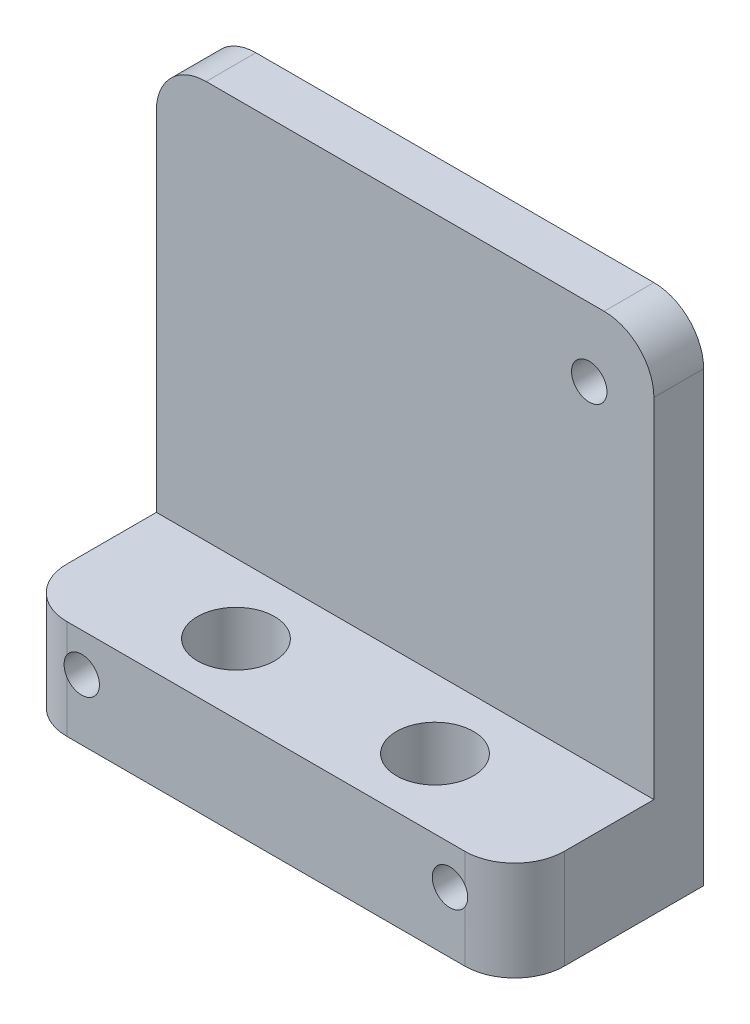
ISO-10303-21;
HEADER;
FILE_DESCRIPTION(('STEP AP214'),'2;1');
FILE_NAME('part.step','',(''),(''),'','','');
FILE_SCHEMA(('AUTOMOTIVE_DESIGN { 1 0 10303 214 1 1 1 1 }'));
ENDSEC;
DATA;
#1=APPLICATION_CONTEXT('core data for automotive mechanical design processes');
#2=APPLICATION_PROTOCOL_DEFINITION('international standard','automotive_design',2000,#1);
#3=PRODUCT_CONTEXT('',#1,'mechanical');
#4=PRODUCT('Part','Part','',(#3));
#5=PRODUCT_RELATED_PRODUCT_CATEGORY('part','',(#4));
#6=PRODUCT_DEFINITION_FORMATION('','',#4);
#7=PRODUCT_DEFINITION_CONTEXT('part definition',#1,'design');
#8=PRODUCT_DEFINITION('design','',#6,#7);
#9=PRODUCT_DEFINITION_SHAPE('','',#8);
#10=(LENGTH_UNIT() NAMED_UNIT(*) SI_UNIT(.MILLI.,.METRE.));
#11=(NAMED_UNIT(*) PLANE_ANGLE_UNIT() SI_UNIT($,.RADIAN.));
#12=(NAMED_UNIT(*) SI_UNIT($,.STERADIAN.) SOLID_ANGLE_UNIT());
#13=UNCERTAINTY_MEASURE_WITH_UNIT(LENGTH_MEASURE(1.E-05),#10,'distance_accuracy_value','');
#14=(GEOMETRIC_REPRESENTATION_CONTEXT(3) GLOBAL_UNCERTAINTY_ASSIGNED_CONTEXT((#13)) GLOBAL_UNIT_ASSIGNED_CONTEXT((#10,
#11,#12)) REPRESENTATION_CONTEXT('',''));
#15=CARTESIAN_POINT('',(0.,0.,0.));
#16=DIRECTION('',(0.,0.,1.));
#17=DIRECTION('',(1.,0.,0.));
#18=AXIS2_PLACEMENT_3D('',#15,#16,#17);
#19=CARTESIAN_POINT('',(15.875,6.35,12.065));
#20=DIRECTION('',(0.,0.,-1.));
#21=DIRECTION('',(-1.,0.,0.));
#22=AXIS2_PLACEMENT_3D('',#19,#20,#21);
#23=PLANE('',#22);
#24=DIRECTION('',(-1.,0.,0.));
#25=VECTOR('',#24,1.);
#26=CARTESIAN_POINT('',(15.875,6.35,12.065));
#27=LINE('',#26,#25);
#28=CARTESIAN_POINT('',(12.7,6.35,12.065));
#29=VERTEX_POINT('',#28);
#30=CARTESIAN_POINT('',(-12.7,6.35,12.065));
#31=VERTEX_POINT('',#30);
#32=EDGE_CURVE('E158',#29,#31,#27,.T.);
#33=ORIENTED_EDGE('',*,*,#32,.T.);
#34=DIRECTION('',(0.,-1.,0.));
#35=VECTOR('',#34,1.);
#36=CARTESIAN_POINT('',(-12.7,6.35,12.065));
#37=LINE('',#36,#35);
#38=CARTESIAN_POINT('',(-12.7,4.49743619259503,12.065));
#39=VERTEX_POINT('',#38);
#40=EDGE_CURVE('E183',#31,#39,#37,.T.);
#41=ORIENTED_EDGE('',*,*,#40,.T.);
#42=CARTESIAN_POINT('',(-11.75,3.88500000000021,12.065));
#43=DIRECTION('',(0.,0.,-1.));
#44=DIRECTION('',(-1.,0.,0.));
#45=AXIS2_PLACEMENT_3D('',#42,#43,#44);
#46=CIRCLE('',#45,1.1303);
#47=CARTESIAN_POINT('',(-12.7,3.27256380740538,12.065));
#48=VERTEX_POINT('',#47);
#49=EDGE_CURVE('E161',#39,#48,#46,.T.);
#50=ORIENTED_EDGE('',*,*,#49,.T.);
#51=DIRECTION('',(0.,-1.,0.));
#52=VECTOR('',#51,1.);
#53=CARTESIAN_POINT('',(-12.7,6.35,12.065));
#54=LINE('',#53,#52);
#55=CARTESIAN_POINT('',(-12.7,0.,12.065));
#56=VERTEX_POINT('',#55);
#57=EDGE_CURVE('E181',#48,#56,#54,.T.);
#58=ORIENTED_EDGE('',*,*,#57,.T.);
#59=DIRECTION('',(-1.,0.,0.));
#60=VECTOR('',#59,1.);
#61=CARTESIAN_POINT('',(15.875,0.,12.065));
#62=LINE('',#61,#60);
#63=CARTESIAN_POINT('',(12.7,0.,12.065));
#64=VERTEX_POINT('',#63);
#65=EDGE_CURVE('E146',#64,#56,#62,.T.);
#66=ORIENTED_EDGE('',*,*,#65,.F.);
#67=DIRECTION('',(0.,-1.,0.));
#68=VECTOR('',#67,1.);
#69=CARTESIAN_POINT('',(12.7,6.35,12.065));
#70=LINE('',#69,#68);
#71=CARTESIAN_POINT('',(12.7,3.27256380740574,12.065));
#72=VERTEX_POINT('',#71);
#73=EDGE_CURVE('E179',#64,#72,#70,.F.);
#74=ORIENTED_EDGE('',*,*,#73,.T.);
#75=CARTESIAN_POINT('',(11.75,3.88500000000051,12.065));
#76=DIRECTION('',(0.,0.,-1.));
#77=DIRECTION('',(-1.,0.,0.));
#78=AXIS2_PLACEMENT_3D('',#75,#76,#77);
#79=CIRCLE('',#78,1.1303);
#80=CARTESIAN_POINT('',(12.7,4.49743619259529,12.065));
#81=VERTEX_POINT('',#80);
#82=EDGE_CURVE('E253',#72,#81,#79,.T.);
#83=ORIENTED_EDGE('',*,*,#82,.T.);
#84=DIRECTION('',(0.,-1.,0.));
#85=VECTOR('',#84,1.);
#86=CARTESIAN_POINT('',(12.7,6.35,12.065));
#87=LINE('',#86,#85);
#88=EDGE_CURVE('E177',#81,#29,#87,.F.);
#89=ORIENTED_EDGE('',*,*,#88,.T.);
#90=EDGE_LOOP('',(#33,#41,#50,#58,#66,#74,#83,#89));
#91=FACE_BOUND('',#90,.T.);
#92=ADVANCED_FACE('F36',(#91),#23,.F.);
#93=CARTESIAN_POINT('',(15.875,0.,12.065));
#94=DIRECTION('',(0.,1.,0.));
#95=DIRECTION('',(0.,0.,1.));
#96=AXIS2_PLACEMENT_3D('',#93,#94,#95);
#97=PLANE('',#96);
#98=CARTESIAN_POINT('',(-6.35,0.,7.62));
#99=DIRECTION('',(0.,1.,0.));
#100=DIRECTION('',(0.,0.,1.));
#101=AXIS2_PLACEMENT_3D('',#98,#99,#100);
#102=CIRCLE('',#101,2.45745);
#103=CARTESIAN_POINT('',(-6.35,0.,10.07745));
#104=VERTEX_POINT('',#103);
#105=EDGE_CURVE('E272',#104,#104,#102,.T.);
#106=ORIENTED_EDGE('',*,*,#105,.T.);
#107=EDGE_LOOP('',(#106));
#108=FACE_BOUND('',#107,.T.);
#109=CARTESIAN_POINT('',(6.35,0.,7.61999999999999));
#110=DIRECTION('',(0.,1.,0.));
#111=DIRECTION('',(0.,0.,1.));
#112=AXIS2_PLACEMENT_3D('',#109,#110,#111);
#113=CIRCLE('',#112,2.45745);
#114=CARTESIAN_POINT('',(6.35,0.,10.07745));
#115=VERTEX_POINT('',#114);
#116=EDGE_CURVE('E266',#115,#115,#113,.T.);
#117=ORIENTED_EDGE('',*,*,#116,.T.);
#118=EDGE_LOOP('',(#117));
#119=FACE_BOUND('',#118,.T.);
#120=ORIENTED_EDGE('',*,*,#65,.T.);
#121=CARTESIAN_POINT('',(-12.7,0.,8.89));
#122=DIRECTION('',(0.,1.,0.));
#123=DIRECTION('',(0.,0.,1.));
#124=AXIS2_PLACEMENT_3D('',#121,#122,#123);
#125=CIRCLE('',#124,3.175);
#126=CARTESIAN_POINT('',(-15.875,0.,8.89));
#127=VERTEX_POINT('',#126);
#128=EDGE_CURVE('E292',#56,#127,#125,.F.);
#129=ORIENTED_EDGE('',*,*,#128,.T.);
#130=DIRECTION('',(0.,0.,-1.));
#131=VECTOR('',#130,1.);
#132=CARTESIAN_POINT('',(-15.875,0.,12.065));
#133=LINE('',#132,#131);
#134=CARTESIAN_POINT('',(-15.875,0.,0.));
#135=VERTEX_POINT('',#134);
#136=EDGE_CURVE('E144',#127,#135,#133,.T.);
#137=ORIENTED_EDGE('',*,*,#136,.T.);
#138=DIRECTION('',(-1.,0.,0.));
#139=VECTOR('',#138,1.);
#140=CARTESIAN_POINT('',(15.875,0.,0.));
#141=LINE('',#140,#139);
#142=CARTESIAN_POINT('',(15.875,0.,0.));
#143=VERTEX_POINT('',#142);
#144=EDGE_CURVE('E140',#143,#135,#141,.T.);
#145=ORIENTED_EDGE('',*,*,#144,.F.);
#146=DIRECTION('',(0.,0.,-1.));
#147=VECTOR('',#146,1.);
#148=CARTESIAN_POINT('',(15.875,0.,12.065));
#149=LINE('',#148,#147);
#150=CARTESIAN_POINT('',(15.875,0.,8.89));
#151=VERTEX_POINT('',#150);
#152=EDGE_CURVE('E126',#151,#143,#149,.T.);
#153=ORIENTED_EDGE('',*,*,#152,.F.);
#154=CARTESIAN_POINT('',(12.7,0.,8.89));
#155=DIRECTION('',(0.,1.,0.));
#156=DIRECTION('',(0.,0.,1.));
#157=AXIS2_PLACEMENT_3D('',#154,#155,#156);
#158=CIRCLE('',#157,3.175);
#159=EDGE_CURVE('E194',#151,#64,#158,.F.);
#160=ORIENTED_EDGE('',*,*,#159,.T.);
#161=EDGE_LOOP('',(#120,#129,#137,#145,#153,#160));
#162=FACE_BOUND('',#161,.T.);
#163=ADVANCED_FACE('F142',(#108,#119,#162),#97,.F.);
#164=CARTESIAN_POINT('',(15.875,0.,0.));
#165=DIRECTION('',(0.,0.,1.));
#166=DIRECTION('',(1.,0.,0.));
#167=AXIS2_PLACEMENT_3D('',#164,#165,#166);
#168=PLANE('',#167);
#169=CARTESIAN_POINT('',(11.75,27.3850000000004,0.));
#170=DIRECTION('',(0.,0.,-1.));
#171=DIRECTION('',(-1.,0.,0.));
#172=AXIS2_PLACEMENT_3D('',#169,#170,#171);
#173=CIRCLE('',#172,1.13029999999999);
#174=CARTESIAN_POINT('',(10.6197,27.3850000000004,0.));
#175=VERTEX_POINT('',#174);
#176=EDGE_CURVE('E263',#175,#175,#173,.T.);
#177=ORIENTED_EDGE('',*,*,#176,.F.);
#178=EDGE_LOOP('',(#177));
#179=FACE_BOUND('',#178,.T.);
#180=CARTESIAN_POINT('',(11.75,3.88500000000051,0.));
#181=DIRECTION('',(0.,0.,-1.));
#182=DIRECTION('',(-1.,0.,0.));
#183=AXIS2_PLACEMENT_3D('',#180,#181,#182);
#184=CIRCLE('',#183,1.13029999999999);
#185=CARTESIAN_POINT('',(10.6197,3.88500000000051,0.));
#186=VERTEX_POINT('',#185);
#187=EDGE_CURVE('E257',#186,#186,#184,.T.);
#188=ORIENTED_EDGE('',*,*,#187,.F.);
#189=EDGE_LOOP('',(#188));
#190=FACE_BOUND('',#189,.T.);
#191=CARTESIAN_POINT('',(-11.75,3.88500000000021,0.));
#192=DIRECTION('',(0.,0.,-1.));
#193=DIRECTION('',(-1.,0.,0.));
#194=AXIS2_PLACEMENT_3D('',#191,#192,#193);
#195=CIRCLE('',#194,1.13029999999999);
#196=CARTESIAN_POINT('',(-12.8803,3.88500000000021,0.));
#197=VERTEX_POINT('',#196);
#198=EDGE_CURVE('E251',#197,#197,#195,.T.);
#199=ORIENTED_EDGE('',*,*,#198,.F.);
#200=EDGE_LOOP('',(#199));
#201=FACE_BOUND('',#200,.T.);
#202=DIRECTION('',(-1.,0.,0.));
#203=VECTOR('',#202,1.);
#204=CARTESIAN_POINT('',(15.875,31.75,0.));
#205=LINE('',#204,#203);
#206=CARTESIAN_POINT('',(12.7,31.75,0.));
#207=VERTEX_POINT('',#206);
#208=CARTESIAN_POINT('',(-12.7,31.75,0.));
#209=VERTEX_POINT('',#208);
#210=EDGE_CURVE('E147',#207,#209,#205,.T.);
#211=ORIENTED_EDGE('',*,*,#210,.F.);
#212=CARTESIAN_POINT('',(12.7,28.575,0.));
#213=DIRECTION('',(0.,0.,1.));
#214=DIRECTION('',(1.,0.,0.));
#215=AXIS2_PLACEMENT_3D('',#212,#213,#214);
#216=CIRCLE('',#215,3.175);
#217=CARTESIAN_POINT('',(15.875,28.575,0.));
#218=VERTEX_POINT('',#217);
#219=EDGE_CURVE('E11',#207,#218,#216,.F.);
#220=ORIENTED_EDGE('',*,*,#219,.T.);
#221=DIRECTION('',(0.,1.,0.));
#222=VECTOR('',#221,1.);
#223=CARTESIAN_POINT('',(15.875,0.,0.));
#224=LINE('',#223,#222);
#225=EDGE_CURVE('E132',#143,#218,#224,.T.);
#226=ORIENTED_EDGE('',*,*,#225,.F.);
#227=ORIENTED_EDGE('',*,*,#144,.T.);
#228=DIRECTION('',(0.,1.,0.));
#229=VECTOR('',#228,1.);
#230=CARTESIAN_POINT('',(-15.875,0.,0.));
#231=LINE('',#230,#229);
#232=CARTESIAN_POINT('',(-15.875,28.575,0.));
#233=VERTEX_POINT('',#232);
#234=EDGE_CURVE('E160',#135,#233,#231,.T.);
#235=ORIENTED_EDGE('',*,*,#234,.T.);
#236=CARTESIAN_POINT('',(-12.7,28.575,0.));
#237=DIRECTION('',(0.,0.,1.));
#238=DIRECTION('',(1.,0.,0.));
#239=AXIS2_PLACEMENT_3D('',#236,#237,#238);
#240=CIRCLE('',#239,3.175);
#241=EDGE_CURVE('E44',#233,#209,#240,.F.);
#242=ORIENTED_EDGE('',*,*,#241,.T.);
#243=EDGE_LOOP('',(#211,#220,#226,#227,#235,#242));
#244=FACE_BOUND('',#243,.T.);
#245=ADVANCED_FACE('F149',(#179,#190,#201,#244),#168,.F.);
#246=CARTESIAN_POINT('',(15.875,31.75,0.));
#247=DIRECTION('',(0.,-1.,0.));
#248=DIRECTION('',(0.,0.,-1.));
#249=AXIS2_PLACEMENT_3D('',#246,#247,#248);
#250=PLANE('',#249);
#251=DIRECTION('',(-1.,0.,0.));
#252=VECTOR('',#251,1.);
#253=CARTESIAN_POINT('',(15.875,31.75,3.175));
#254=LINE('',#253,#252);
#255=CARTESIAN_POINT('',(12.7,31.75,3.175));
#256=VERTEX_POINT('',#255);
#257=CARTESIAN_POINT('',(-12.7,31.75,3.175));
#258=VERTEX_POINT('',#257);
#259=EDGE_CURVE('E172',#256,#258,#254,.T.);
#260=ORIENTED_EDGE('',*,*,#259,.F.);
#261=DIRECTION('',(0.,0.,1.));
#262=VECTOR('',#261,1.);
#263=CARTESIAN_POINT('',(12.7,31.75,0.));
#264=LINE('',#263,#262);
#265=EDGE_CURVE('E57',#256,#207,#264,.F.);
#266=ORIENTED_EDGE('',*,*,#265,.T.);
#267=ORIENTED_EDGE('',*,*,#210,.T.);
#268=DIRECTION('',(0.,0.,1.));
#269=VECTOR('',#268,1.);
#270=CARTESIAN_POINT('',(-12.7,31.75,0.));
#271=LINE('',#270,#269);
#272=EDGE_CURVE('E455',#209,#258,#271,.T.);
#273=ORIENTED_EDGE('',*,*,#272,.T.);
#274=EDGE_LOOP('',(#260,#266,#267,#273));
#275=FACE_BOUND('',#274,.T.);
#276=ADVANCED_FACE('F222',(#275),#250,.F.);
#277=CARTESIAN_POINT('',(15.875,31.75,3.175));
#278=DIRECTION('',(0.,0.,-1.));
#279=DIRECTION('',(0.,1.,0.));
#280=AXIS2_PLACEMENT_3D('',#277,#278,#279);
#281=PLANE('',#280);
#282=CARTESIAN_POINT('',(11.75,27.3850000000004,3.175));
#283=DIRECTION('',(0.,0.,-1.));
#284=DIRECTION('',(0.,1.,0.));
#285=AXIS2_PLACEMENT_3D('',#282,#283,#284);
#286=CIRCLE('',#285,1.13029999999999);
#287=CARTESIAN_POINT('',(11.75,28.5153000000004,3.175));
#288=VERTEX_POINT('',#287);
#289=EDGE_CURVE('E260',#288,#288,#286,.T.);
#290=ORIENTED_EDGE('',*,*,#289,.T.);
#291=EDGE_LOOP('',(#290));
#292=FACE_BOUND('',#291,.T.);
#293=DIRECTION('',(0.,-1.,0.));
#294=VECTOR('',#293,1.);
#295=CARTESIAN_POINT('',(15.875,31.75,3.175));
#296=LINE('',#295,#294);
#297=CARTESIAN_POINT('',(15.875,28.575,3.175));
#298=VERTEX_POINT('',#297);
#299=CARTESIAN_POINT('',(15.875,6.35,3.175));
#300=VERTEX_POINT('',#299);
#301=EDGE_CURVE('E151',#298,#300,#296,.T.);
#302=ORIENTED_EDGE('',*,*,#301,.F.);
#303=CARTESIAN_POINT('',(12.7,28.575,3.175));
#304=DIRECTION('',(0.,0.,-1.));
#305=DIRECTION('',(0.,1.,0.));
#306=AXIS2_PLACEMENT_3D('',#303,#304,#305);
#307=CIRCLE('',#306,3.175);
#308=EDGE_CURVE('E318',#298,#256,#307,.F.);
#309=ORIENTED_EDGE('',*,*,#308,.T.);
#310=ORIENTED_EDGE('',*,*,#259,.T.);
#311=CARTESIAN_POINT('',(-12.7,28.575,3.175));
#312=DIRECTION('',(0.,0.,-1.));
#313=DIRECTION('',(0.,1.,0.));
#314=AXIS2_PLACEMENT_3D('',#311,#312,#313);
#315=CIRCLE('',#314,3.175);
#316=CARTESIAN_POINT('',(-15.875,28.575,3.175));
#317=VERTEX_POINT('',#316);
#318=EDGE_CURVE('E305',#258,#317,#315,.F.);
#319=ORIENTED_EDGE('',*,*,#318,.T.);
#320=DIRECTION('',(0.,-1.,0.));
#321=VECTOR('',#320,1.);
#322=CARTESIAN_POINT('',(-15.875,31.75,3.175));
#323=LINE('',#322,#321);
#324=CARTESIAN_POINT('',(-15.875,6.35,3.175));
#325=VERTEX_POINT('',#324);
#326=EDGE_CURVE('E163',#317,#325,#323,.T.);
#327=ORIENTED_EDGE('',*,*,#326,.T.);
#328=DIRECTION('',(-1.,0.,0.));
#329=VECTOR('',#328,1.);
#330=CARTESIAN_POINT('',(15.875,6.35,3.175));
#331=LINE('',#330,#329);
#332=EDGE_CURVE('E169',#300,#325,#331,.T.);
#333=ORIENTED_EDGE('',*,*,#332,.F.);
#334=EDGE_LOOP('',(#302,#309,#310,#319,#327,#333));
#335=FACE_BOUND('',#334,.T.);
#336=ADVANCED_FACE('F218',(#292,#335),#281,.F.);
#337=CARTESIAN_POINT('',(15.875,6.35,3.175));
#338=DIRECTION('',(0.,-1.,0.));
#339=DIRECTION('',(0.,0.,-1.));
#340=AXIS2_PLACEMENT_3D('',#337,#338,#339);
#341=PLANE('',#340);
#342=CARTESIAN_POINT('',(-6.35,6.35,7.62));
#343=DIRECTION('',(0.,1.,0.));
#344=DIRECTION('',(0.,0.,1.));
#345=AXIS2_PLACEMENT_3D('',#342,#343,#344);
#346=CIRCLE('',#345,2.45745);
#347=CARTESIAN_POINT('',(-6.35,6.35,10.07745));
#348=VERTEX_POINT('',#347);
#349=EDGE_CURVE('E275',#348,#348,#346,.T.);
#350=ORIENTED_EDGE('',*,*,#349,.F.);
#351=EDGE_LOOP('',(#350));
#352=FACE_BOUND('',#351,.T.);
#353=CARTESIAN_POINT('',(6.35,6.35,7.62));
#354=DIRECTION('',(0.,1.,0.));
#355=DIRECTION('',(0.,0.,1.));
#356=AXIS2_PLACEMENT_3D('',#353,#354,#355);
#357=CIRCLE('',#356,2.45745);
#358=CARTESIAN_POINT('',(6.35,6.35,10.07745));
#359=VERTEX_POINT('',#358);
#360=EDGE_CURVE('E269',#359,#359,#357,.T.);
#361=ORIENTED_EDGE('',*,*,#360,.F.);
#362=EDGE_LOOP('',(#361));
#363=FACE_BOUND('',#362,.T.);
#364=DIRECTION('',(0.,0.,1.));
#365=VECTOR('',#364,1.);
#366=CARTESIAN_POINT('',(-15.875,6.35,3.175));
#367=LINE('',#366,#365);
#368=CARTESIAN_POINT('',(-15.875,6.35,8.89));
#369=VERTEX_POINT('',#368);
#370=EDGE_CURVE('E137',#325,#369,#367,.T.);
#371=ORIENTED_EDGE('',*,*,#370,.T.);
#372=CARTESIAN_POINT('',(-12.7,6.35,8.89));
#373=DIRECTION('',(0.,-1.,0.));
#374=DIRECTION('',(0.,0.,-1.));
#375=AXIS2_PLACEMENT_3D('',#372,#373,#374);
#376=CIRCLE('',#375,3.175);
#377=EDGE_CURVE('E246',#369,#31,#376,.F.);
#378=ORIENTED_EDGE('',*,*,#377,.T.);
#379=ORIENTED_EDGE('',*,*,#32,.F.);
#380=CARTESIAN_POINT('',(12.7,6.35,8.89));
#381=DIRECTION('',(0.,-1.,0.));
#382=DIRECTION('',(0.,0.,-1.));
#383=AXIS2_PLACEMENT_3D('',#380,#381,#382);
#384=CIRCLE('',#383,3.175);
#385=CARTESIAN_POINT('',(15.875,6.35,8.89));
#386=VERTEX_POINT('',#385);
#387=EDGE_CURVE('E288',#29,#386,#384,.F.);
#388=ORIENTED_EDGE('',*,*,#387,.T.);
#389=DIRECTION('',(0.,0.,1.));
#390=VECTOR('',#389,1.);
#391=CARTESIAN_POINT('',(15.875,6.35,3.175));
#392=LINE('',#391,#390);
#393=EDGE_CURVE('E153',#300,#386,#392,.T.);
#394=ORIENTED_EDGE('',*,*,#393,.F.);
#395=ORIENTED_EDGE('',*,*,#332,.T.);
#396=EDGE_LOOP('',(#371,#378,#379,#388,#394,#395));
#397=FACE_BOUND('',#396,.T.);
#398=ADVANCED_FACE('F212',(#352,#363,#397),#341,.F.);
#399=CARTESIAN_POINT('',(15.875,0.,0.));
#400=DIRECTION('',(1.,0.,0.));
#401=DIRECTION('',(0.,0.,-1.));
#402=AXIS2_PLACEMENT_3D('',#399,#400,#401);
#403=PLANE('',#402);
#404=ORIENTED_EDGE('',*,*,#393,.T.);
#405=DIRECTION('',(0.,-1.,0.));
#406=VECTOR('',#405,1.);
#407=CARTESIAN_POINT('',(15.875,0.,8.89));
#408=LINE('',#407,#406);
#409=EDGE_CURVE('E135',#386,#151,#408,.T.);
#410=ORIENTED_EDGE('',*,*,#409,.T.);
#411=ORIENTED_EDGE('',*,*,#152,.T.);
#412=ORIENTED_EDGE('',*,*,#225,.T.);
#413=DIRECTION('',(0.,0.,1.));
#414=VECTOR('',#413,1.);
#415=CARTESIAN_POINT('',(15.875,28.575,3.175));
#416=LINE('',#415,#414);
#417=EDGE_CURVE('E296',#218,#298,#416,.T.);
#418=ORIENTED_EDGE('',*,*,#417,.T.);
#419=ORIENTED_EDGE('',*,*,#301,.T.);
#420=EDGE_LOOP('',(#404,#410,#411,#412,#418,#419));
#421=FACE_BOUND('',#420,.T.);
#422=ADVANCED_FACE('F129',(#421),#403,.T.);
#423=CARTESIAN_POINT('',(-15.875,0.,0.));
#424=DIRECTION('',(1.,0.,0.));
#425=DIRECTION('',(0.,0.,-1.));
#426=AXIS2_PLACEMENT_3D('',#423,#424,#425);
#427=PLANE('',#426);
#428=ORIENTED_EDGE('',*,*,#136,.F.);
#429=DIRECTION('',(0.,-1.,0.));
#430=VECTOR('',#429,1.);
#431=CARTESIAN_POINT('',(-15.875,0.,8.89));
#432=LINE('',#431,#430);
#433=EDGE_CURVE('E287',#127,#369,#432,.F.);
#434=ORIENTED_EDGE('',*,*,#433,.T.);
#435=ORIENTED_EDGE('',*,*,#370,.F.);
#436=ORIENTED_EDGE('',*,*,#326,.F.);
#437=DIRECTION('',(0.,0.,1.));
#438=VECTOR('',#437,1.);
#439=CARTESIAN_POINT('',(-15.875,28.575,0.));
#440=LINE('',#439,#438);
#441=EDGE_CURVE('E289',#317,#233,#440,.F.);
#442=ORIENTED_EDGE('',*,*,#441,.T.);
#443=ORIENTED_EDGE('',*,*,#234,.F.);
#444=EDGE_LOOP('',(#428,#434,#435,#436,#442,#443));
#445=FACE_BOUND('',#444,.T.);
#446=ADVANCED_FACE('F206',(#445),#427,.F.);
#447=CARTESIAN_POINT('',(-11.75,3.88500000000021,0.));
#448=DIRECTION('',(0.,0.,-1.));
#449=DIRECTION('',(-1.,0.,0.));
#450=AXIS2_PLACEMENT_3D('',#447,#448,#449);
#451=CYLINDRICAL_SURFACE('',#450,1.13029999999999);
#452=ORIENTED_EDGE('',*,*,#49,.F.);
#453=CARTESIAN_POINT('',(-12.7,4.49743619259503,12.065));
#454=CARTESIAN_POINT('',(-12.7172259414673,4.4707152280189,12.0649988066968));
#455=CARTESIAN_POINT('',(-12.7333155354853,4.44328064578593,12.0648600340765));
#456=CARTESIAN_POINT('',(-12.763127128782,4.38715749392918,12.0644075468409));
#457=CARTESIAN_POINT('',(-12.7768492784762,4.35846900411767,12.0640938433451));
#458=CARTESIAN_POINT('',(-12.8142831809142,4.27087583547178,12.0630417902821));
#459=CARTESIAN_POINT('',(-12.8343210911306,4.21035219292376,12.0621918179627));
#460=CARTESIAN_POINT('',(-12.8639548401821,4.0868055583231,12.0607989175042));
#461=CARTESIAN_POINT('',(-12.8735467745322,4.02378164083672,12.060256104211));
#462=CARTESIAN_POINT('',(-12.8820190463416,3.89700027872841,12.0597811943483));
#463=CARTESIAN_POINT('',(-12.8808986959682,3.83324278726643,12.0598491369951));
#464=CARTESIAN_POINT('',(-12.8679808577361,3.70685916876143,12.0605596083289));
#465=CARTESIAN_POINT('',(-12.8561873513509,3.64423262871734,12.0612019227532));
#466=CARTESIAN_POINT('',(-12.8222600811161,3.52188065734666,12.0626901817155));
#467=CARTESIAN_POINT('',(-12.8001376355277,3.46215212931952,12.0635359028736));
#468=CARTESIAN_POINT('',(-12.762484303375,3.38191594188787,12.0644027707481));
#469=CARTESIAN_POINT('',(-12.7510014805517,3.35944141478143,12.0646138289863));
#470=CARTESIAN_POINT('',(-12.7265814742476,3.31535174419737,12.0649122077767));
#471=CARTESIAN_POINT('',(-12.7136470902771,3.29373505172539,12.0649997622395));
#472=CARTESIAN_POINT('',(-12.7,3.27256380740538,12.065));
#473=B_SPLINE_CURVE_WITH_KNOTS('',3,(#453,#454,#455,#456,#457,#458,#459,#460,#461,#462,#463,
#464,#465,#466,#467,#468,#469,#470,#471,#472),.UNSPECIFIED.,.F.,.F.,(4,2,2,2,2,2,2,2,2,4),(0.,
0.0953167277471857,0.190627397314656,0.380927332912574,0.571298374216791,0.761681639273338,
0.951993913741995,1.14209813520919,1.21776986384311,1.2932980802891),.UNSPECIFIED.);
#474=EDGE_CURVE('E186',#39,#48,#473,.T.);
#475=ORIENTED_EDGE('',*,*,#474,.T.);
#476=EDGE_LOOP('',(#452,#475));
#477=FACE_BOUND('',#476,.T.);
#478=ORIENTED_EDGE('',*,*,#198,.T.);
#479=EDGE_LOOP('',(#478));
#480=FACE_BOUND('',#479,.T.);
#481=ADVANCED_FACE('F200',(#477,#480),#451,.F.);
#482=CARTESIAN_POINT('',(11.75,3.88500000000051,0.));
#483=DIRECTION('',(0.,0.,-1.));
#484=DIRECTION('',(-1.,0.,0.));
#485=AXIS2_PLACEMENT_3D('',#482,#483,#484);
#486=CYLINDRICAL_SURFACE('',#485,1.13029999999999);
#487=ORIENTED_EDGE('',*,*,#82,.F.);
#488=CARTESIAN_POINT('',(12.7,3.27256380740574,12.065));
#489=CARTESIAN_POINT('',(12.7172259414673,3.29928477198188,12.0649988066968));
#490=CARTESIAN_POINT('',(12.7333155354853,3.32671935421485,12.0648600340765));
#491=CARTESIAN_POINT('',(12.763127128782,3.3828425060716,12.0644075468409));
#492=CARTESIAN_POINT('',(12.7768492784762,3.41153099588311,12.0640938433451));
#493=CARTESIAN_POINT('',(12.8142831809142,3.49912416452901,12.0630417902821));
#494=CARTESIAN_POINT('',(12.8343210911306,3.55964780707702,12.0621918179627));
#495=CARTESIAN_POINT('',(12.8639548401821,3.68319444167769,12.0607989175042));
#496=CARTESIAN_POINT('',(12.8735467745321,3.74621835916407,12.060256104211));
#497=CARTESIAN_POINT('',(12.8820190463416,3.87299972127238,12.0597811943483));
#498=CARTESIAN_POINT('',(12.8808986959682,3.93675721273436,12.0598491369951));
#499=CARTESIAN_POINT('',(12.8679808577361,4.06314083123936,12.0605596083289));
#500=CARTESIAN_POINT('',(12.8561873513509,4.12576737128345,12.0612019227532));
#501=CARTESIAN_POINT('',(12.8222600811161,4.24811934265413,12.0626901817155));
#502=CARTESIAN_POINT('',(12.8001376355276,4.30784787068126,12.0635359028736));
#503=CARTESIAN_POINT('',(12.7624843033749,4.38808405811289,12.0644027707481));
#504=CARTESIAN_POINT('',(12.7510014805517,4.41055858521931,12.0646138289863));
#505=CARTESIAN_POINT('',(12.7265814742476,4.45464825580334,12.0649122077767));
#506=CARTESIAN_POINT('',(12.7136470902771,4.4762649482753,12.0649997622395));
#507=CARTESIAN_POINT('',(12.7,4.49743619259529,12.065));
#508=B_SPLINE_CURVE_WITH_KNOTS('',3,(#488,#489,#490,#491,#492,#493,#494,#495,#496,#497,#498,
#499,#500,#501,#502,#503,#504,#505,#506,#507),.UNSPECIFIED.,.F.,.F.,(4,2,2,2,2,2,2,2,2,4),(0.,
0.0953167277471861,0.190627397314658,0.380927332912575,0.571298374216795,0.761681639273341,
0.951993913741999,1.14209813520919,1.21776986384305,1.29329808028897),.UNSPECIFIED.);
#509=EDGE_CURVE('E299',#72,#81,#508,.T.);
#510=ORIENTED_EDGE('',*,*,#509,.T.);
#511=EDGE_LOOP('',(#487,#510));
#512=FACE_BOUND('',#511,.T.);
#513=ORIENTED_EDGE('',*,*,#187,.T.);
#514=EDGE_LOOP('',(#513));
#515=FACE_BOUND('',#514,.T.);
#516=ADVANCED_FACE('F205',(#512,#515),#486,.F.);
#517=CARTESIAN_POINT('',(11.75,27.3850000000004,0.));
#518=DIRECTION('',(0.,0.,-1.));
#519=DIRECTION('',(-1.,0.,0.));
#520=AXIS2_PLACEMENT_3D('',#517,#518,#519);
#521=CYLINDRICAL_SURFACE('',#520,1.13029999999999);
#522=ORIENTED_EDGE('',*,*,#176,.T.);
#523=EDGE_LOOP('',(#522));
#524=FACE_BOUND('',#523,.T.);
#525=ORIENTED_EDGE('',*,*,#289,.F.);
#526=EDGE_LOOP('',(#525));
#527=FACE_BOUND('',#526,.T.);
#528=ADVANCED_FACE('F327',(#524,#527),#521,.F.);
#529=CARTESIAN_POINT('',(6.35,6.35,7.62));
#530=DIRECTION('',(0.,1.,0.));
#531=DIRECTION('',(0.,0.,1.));
#532=AXIS2_PLACEMENT_3D('',#529,#530,#531);
#533=CYLINDRICAL_SURFACE('',#532,2.45745);
#534=ORIENTED_EDGE('',*,*,#116,.F.);
#535=EDGE_LOOP('',(#534));
#536=FACE_BOUND('',#535,.T.);
#537=ORIENTED_EDGE('',*,*,#360,.T.);
#538=EDGE_LOOP('',(#537));
#539=FACE_BOUND('',#538,.T.);
#540=ADVANCED_FACE('F335',(#536,#539),#533,.F.);
#541=CARTESIAN_POINT('',(-6.35,6.35,7.62));
#542=DIRECTION('',(0.,1.,0.));
#543=DIRECTION('',(0.,0.,1.));
#544=AXIS2_PLACEMENT_3D('',#541,#542,#543);
#545=CYLINDRICAL_SURFACE('',#544,2.45745);
#546=ORIENTED_EDGE('',*,*,#105,.F.);
#547=EDGE_LOOP('',(#546));
#548=FACE_BOUND('',#547,.T.);
#549=ORIENTED_EDGE('',*,*,#349,.T.);
#550=EDGE_LOOP('',(#549));
#551=FACE_BOUND('',#550,.T.);
#552=ADVANCED_FACE('F279',(#548,#551),#545,.F.);
#553=CARTESIAN_POINT('',(-12.7,6.35,8.89));
#554=DIRECTION('',(0.,-1.,0.));
#555=DIRECTION('',(0.,0.,-1.));
#556=AXIS2_PLACEMENT_3D('',#553,#554,#555);
#557=CYLINDRICAL_SURFACE('',#556,3.175);
#558=ORIENTED_EDGE('',*,*,#377,.F.);
#559=ORIENTED_EDGE('',*,*,#433,.F.);
#560=ORIENTED_EDGE('',*,*,#128,.F.);
#561=ORIENTED_EDGE('',*,*,#57,.F.);
#562=ORIENTED_EDGE('',*,*,#474,.F.);
#563=ORIENTED_EDGE('',*,*,#40,.F.);
#564=EDGE_LOOP('',(#558,#559,#560,#561,#562,#563));
#565=FACE_BOUND('',#564,.T.);
#566=ADVANCED_FACE('F196',(#565),#557,.T.);
#567=CARTESIAN_POINT('',(12.7,0.,8.89));
#568=DIRECTION('',(0.,1.,0.));
#569=DIRECTION('',(0.,0.,1.));
#570=AXIS2_PLACEMENT_3D('',#567,#568,#569);
#571=CYLINDRICAL_SURFACE('',#570,3.175);
#572=ORIENTED_EDGE('',*,*,#509,.F.);
#573=ORIENTED_EDGE('',*,*,#73,.F.);
#574=ORIENTED_EDGE('',*,*,#159,.F.);
#575=ORIENTED_EDGE('',*,*,#409,.F.);
#576=ORIENTED_EDGE('',*,*,#387,.F.);
#577=ORIENTED_EDGE('',*,*,#88,.F.);
#578=EDGE_LOOP('',(#572,#573,#574,#575,#576,#577));
#579=FACE_BOUND('',#578,.T.);
#580=ADVANCED_FACE('F307',(#579),#571,.T.);
#581=CARTESIAN_POINT('',(12.7,28.575,0.));
#582=DIRECTION('',(0.,0.,-1.));
#583=DIRECTION('',(-1.,0.,0.));
#584=AXIS2_PLACEMENT_3D('',#581,#582,#583);
#585=CYLINDRICAL_SURFACE('',#584,3.175);
#586=ORIENTED_EDGE('',*,*,#219,.F.);
#587=ORIENTED_EDGE('',*,*,#265,.F.);
#588=ORIENTED_EDGE('',*,*,#308,.F.);
#589=ORIENTED_EDGE('',*,*,#417,.F.);
#590=EDGE_LOOP('',(#586,#587,#588,#589));
#591=FACE_BOUND('',#590,.T.);
#592=ADVANCED_FACE('F310',(#591),#585,.T.);
#593=CARTESIAN_POINT('',(-12.7,28.575,0.));
#594=DIRECTION('',(0.,0.,1.));
#595=DIRECTION('',(1.,0.,0.));
#596=AXIS2_PLACEMENT_3D('',#593,#594,#595);
#597=CYLINDRICAL_SURFACE('',#596,3.175);
#598=ORIENTED_EDGE('',*,*,#241,.F.);
#599=ORIENTED_EDGE('',*,*,#441,.F.);
#600=ORIENTED_EDGE('',*,*,#318,.F.);
#601=ORIENTED_EDGE('',*,*,#272,.F.);
#602=EDGE_LOOP('',(#598,#599,#600,#601));
#603=FACE_BOUND('',#602,.T.);
#604=ADVANCED_FACE('F38',(#603),#597,.T.);
#605=CLOSED_SHELL('',(#92,#163,#245,#276,#336,#398,#422,#446,#481,#516,#528,#540,#552,#566,#580,
#592,#604));
#606=MANIFOLD_SOLID_BREP('B2',#605);
#607=ADVANCED_BREP_SHAPE_REPRESENTATION('',(#18,#606),#14);
#608=SHAPE_DEFINITION_REPRESENTATION(#9,#607);
ENDSEC;
END-ISO-10303-21;
